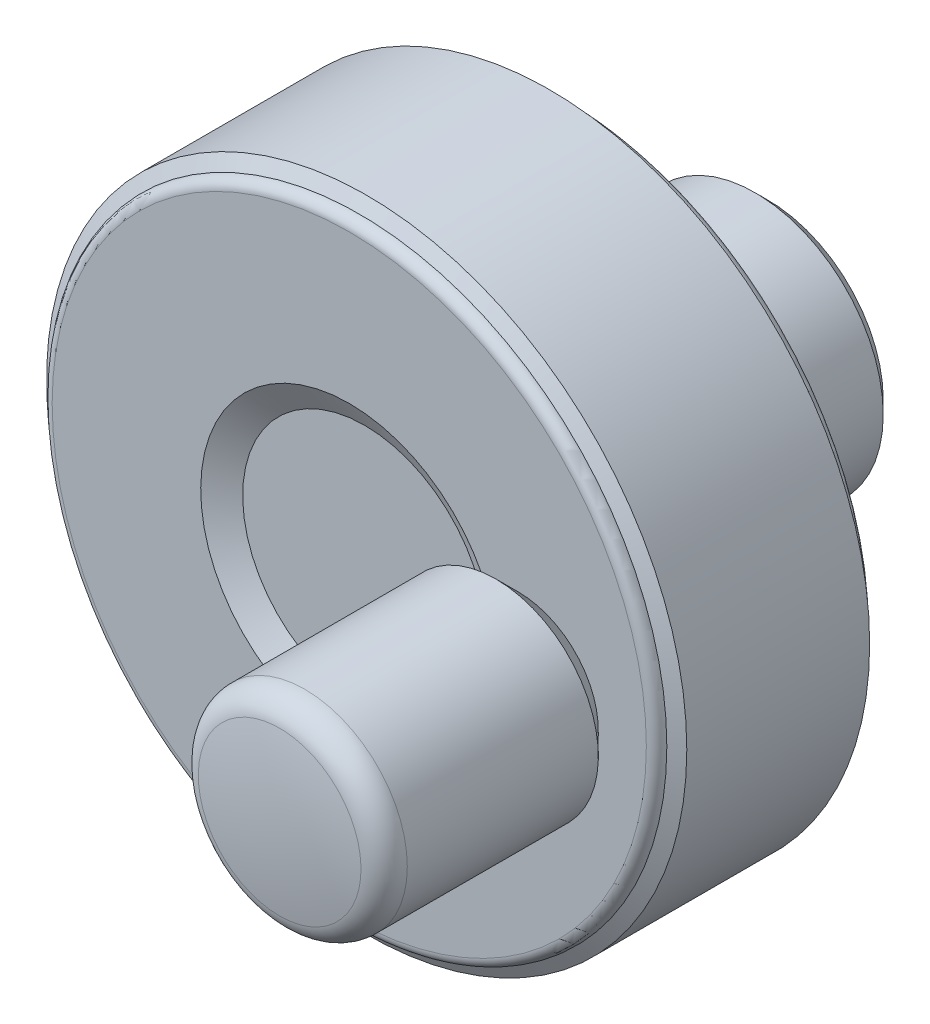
ISO-10303-21;
HEADER;
FILE_DESCRIPTION(('STEP AP214'),'2;1');
FILE_NAME('part.step','',(''),(''),'','','');
FILE_SCHEMA(('AUTOMOTIVE_DESIGN { 1 0 10303 214 1 1 1 1 }'));
ENDSEC;
DATA;
#1=APPLICATION_CONTEXT('core data for automotive mechanical design processes');
#2=APPLICATION_PROTOCOL_DEFINITION('international standard','automotive_design',2000,#1);
#3=PRODUCT_CONTEXT('',#1,'mechanical');
#4=PRODUCT('Part','Part','',(#3));
#5=PRODUCT_RELATED_PRODUCT_CATEGORY('part','',(#4));
#6=PRODUCT_DEFINITION_FORMATION('','',#4);
#7=PRODUCT_DEFINITION_CONTEXT('part definition',#1,'design');
#8=PRODUCT_DEFINITION('design','',#6,#7);
#9=PRODUCT_DEFINITION_SHAPE('','',#8);
#10=(LENGTH_UNIT() NAMED_UNIT(*) SI_UNIT(.MILLI.,.METRE.));
#11=(NAMED_UNIT(*) PLANE_ANGLE_UNIT() SI_UNIT($,.RADIAN.));
#12=(NAMED_UNIT(*) SI_UNIT($,.STERADIAN.) SOLID_ANGLE_UNIT());
#13=UNCERTAINTY_MEASURE_WITH_UNIT(LENGTH_MEASURE(1.E-05),#10,'distance_accuracy_value','');
#14=(GEOMETRIC_REPRESENTATION_CONTEXT(3) GLOBAL_UNCERTAINTY_ASSIGNED_CONTEXT((#13)) GLOBAL_UNIT_ASSIGNED_CONTEXT((#10,
#11,#12)) REPRESENTATION_CONTEXT('',''));
#15=CARTESIAN_POINT('',(0.,0.,0.));
#16=DIRECTION('',(0.,0.,1.));
#17=DIRECTION('',(1.,0.,0.));
#18=AXIS2_PLACEMENT_3D('',#15,#16,#17);
#19=CARTESIAN_POINT('',(-7.66666666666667,0.,3.55662432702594));
#20=DIRECTION('',(0.,-0.5,-0.866025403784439));
#21=DIRECTION('',(0.,-0.866025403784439,0.5));
#22=AXIS2_PLACEMENT_3D('',#19,#20,#21);
#23=PLANE('',#22);
#24=DIRECTION('',(1.,0.,0.));
#25=VECTOR('',#24,1.);
#26=CARTESIAN_POINT('',(-7.66666666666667,-1.25,4.27831216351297));
#27=LINE('',#26,#25);
#28=CARTESIAN_POINT('',(-10.,-1.25,4.27831216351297));
#29=VERTEX_POINT('',#28);
#30=CARTESIAN_POINT('',(-7.66666666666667,-1.25,4.27831216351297));
#31=VERTEX_POINT('',#30);
#32=EDGE_CURVE('E185',#29,#31,#27,.T.);
#33=ORIENTED_EDGE('',*,*,#32,.T.);
#34=DIRECTION('',(0.,-0.866025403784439,0.5));
#35=VECTOR('',#34,1.);
#36=CARTESIAN_POINT('',(-7.66666666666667,0.,3.55662432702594));
#37=LINE('',#36,#35);
#38=CARTESIAN_POINT('',(-7.66666666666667,0.,3.55662432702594));
#39=VERTEX_POINT('',#38);
#40=EDGE_CURVE('E173',#39,#31,#37,.T.);
#41=ORIENTED_EDGE('',*,*,#40,.F.);
#42=DIRECTION('',(-1.,0.,0.));
#43=VECTOR('',#42,1.);
#44=CARTESIAN_POINT('',(-7.66666666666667,0.,3.55662432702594));
#45=LINE('',#44,#43);
#46=CARTESIAN_POINT('',(-10.,0.,3.55662432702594));
#47=VERTEX_POINT('',#46);
#48=EDGE_CURVE('E199',#39,#47,#45,.T.);
#49=ORIENTED_EDGE('',*,*,#48,.T.);
#50=DIRECTION('',(0.,-0.866025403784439,0.5));
#51=VECTOR('',#50,1.);
#52=CARTESIAN_POINT('',(-10.,0.,3.55662432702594));
#53=LINE('',#52,#51);
#54=EDGE_CURVE('E177',#29,#47,#53,.F.);
#55=ORIENTED_EDGE('',*,*,#54,.F.);
#56=EDGE_LOOP('',(#33,#41,#49,#55));
#57=FACE_BOUND('',#56,.T.);
#58=ADVANCED_FACE('F14',(#57),#23,.F.);
#59=CARTESIAN_POINT('',(-7.66666666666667,-1.25,4.27831216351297));
#60=DIRECTION('',(0.,-1.,0.));
#61=DIRECTION('',(1.,0.,0.));
#62=AXIS2_PLACEMENT_3D('',#59,#60,#61);
#63=PLANE('',#62);
#64=DIRECTION('',(-1.,0.,0.));
#65=VECTOR('',#64,1.);
#66=CARTESIAN_POINT('',(-7.66666666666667,-1.25,5.72168783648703));
#67=LINE('',#66,#65);
#68=CARTESIAN_POINT('',(-10.,-1.25,5.72168783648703));
#69=VERTEX_POINT('',#68);
#70=CARTESIAN_POINT('',(-7.66666666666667,-1.25,5.72168783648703));
#71=VERTEX_POINT('',#70);
#72=EDGE_CURVE('E204',#69,#71,#67,.F.);
#73=ORIENTED_EDGE('',*,*,#72,.T.);
#74=DIRECTION('',(0.,0.,1.));
#75=VECTOR('',#74,1.);
#76=CARTESIAN_POINT('',(-7.66666666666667,-1.25,4.27831216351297));
#77=LINE('',#76,#75);
#78=EDGE_CURVE('E190',#31,#71,#77,.T.);
#79=ORIENTED_EDGE('',*,*,#78,.F.);
#80=ORIENTED_EDGE('',*,*,#32,.F.);
#81=DIRECTION('',(0.,0.,1.));
#82=VECTOR('',#81,1.);
#83=CARTESIAN_POINT('',(-10.,-1.25,4.27831216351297));
#84=LINE('',#83,#82);
#85=EDGE_CURVE('E197',#69,#29,#84,.F.);
#86=ORIENTED_EDGE('',*,*,#85,.F.);
#87=EDGE_LOOP('',(#73,#79,#80,#86));
#88=FACE_BOUND('',#87,.T.);
#89=ADVANCED_FACE('F599',(#88),#63,.F.);
#90=CARTESIAN_POINT('',(-7.66666666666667,1.25,4.27831216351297));
#91=DIRECTION('',(0.,0.5,-0.866025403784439));
#92=DIRECTION('',(0.,-0.866025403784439,-0.5));
#93=AXIS2_PLACEMENT_3D('',#90,#91,#92);
#94=PLANE('',#93);
#95=ORIENTED_EDGE('',*,*,#48,.F.);
#96=DIRECTION('',(0.,-0.866025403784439,-0.5));
#97=VECTOR('',#96,1.);
#98=CARTESIAN_POINT('',(-7.66666666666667,1.25,4.27831216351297));
#99=LINE('',#98,#97);
#100=CARTESIAN_POINT('',(-7.66666666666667,1.25,4.27831216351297));
#101=VERTEX_POINT('',#100);
#102=EDGE_CURVE('E208',#101,#39,#99,.T.);
#103=ORIENTED_EDGE('',*,*,#102,.F.);
#104=DIRECTION('',(-1.,0.,0.));
#105=VECTOR('',#104,1.);
#106=CARTESIAN_POINT('',(-7.66666666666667,1.25,4.27831216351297));
#107=LINE('',#106,#105);
#108=CARTESIAN_POINT('',(-10.,1.25,4.27831216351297));
#109=VERTEX_POINT('',#108);
#110=EDGE_CURVE('E216',#101,#109,#107,.T.);
#111=ORIENTED_EDGE('',*,*,#110,.T.);
#112=DIRECTION('',(0.,-0.866025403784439,-0.5));
#113=VECTOR('',#112,1.);
#114=CARTESIAN_POINT('',(-10.,1.25,4.27831216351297));
#115=LINE('',#114,#113);
#116=EDGE_CURVE('E202',#47,#109,#115,.F.);
#117=ORIENTED_EDGE('',*,*,#116,.F.);
#118=EDGE_LOOP('',(#95,#103,#111,#117));
#119=FACE_BOUND('',#118,.T.);
#120=ADVANCED_FACE('F591',(#119),#94,.F.);
#121=CARTESIAN_POINT('',(-7.66666666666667,-1.25,5.72168783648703));
#122=DIRECTION('',(0.,-0.5,0.866025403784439));
#123=DIRECTION('',(0.,0.866025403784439,0.5));
#124=AXIS2_PLACEMENT_3D('',#121,#122,#123);
#125=PLANE('',#124);
#126=DIRECTION('',(-1.,0.,0.));
#127=VECTOR('',#126,1.);
#128=CARTESIAN_POINT('',(-7.66666666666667,0.,6.44337567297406));
#129=LINE('',#128,#127);
#130=CARTESIAN_POINT('',(-10.,0.,6.44337567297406));
#131=VERTEX_POINT('',#130);
#132=CARTESIAN_POINT('',(-7.66666666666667,0.,6.44337567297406));
#133=VERTEX_POINT('',#132);
#134=EDGE_CURVE('E221',#131,#133,#129,.F.);
#135=ORIENTED_EDGE('',*,*,#134,.T.);
#136=DIRECTION('',(0.,0.866025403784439,0.5));
#137=VECTOR('',#136,1.);
#138=CARTESIAN_POINT('',(-7.66666666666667,-1.25,5.72168783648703));
#139=LINE('',#138,#137);
#140=EDGE_CURVE('E211',#71,#133,#139,.T.);
#141=ORIENTED_EDGE('',*,*,#140,.F.);
#142=ORIENTED_EDGE('',*,*,#72,.F.);
#143=DIRECTION('',(0.,0.866025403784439,0.5));
#144=VECTOR('',#143,1.);
#145=CARTESIAN_POINT('',(-10.,-1.25,5.72168783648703));
#146=LINE('',#145,#144);
#147=EDGE_CURVE('E34',#131,#69,#146,.F.);
#148=ORIENTED_EDGE('',*,*,#147,.F.);
#149=EDGE_LOOP('',(#135,#141,#142,#148));
#150=FACE_BOUND('',#149,.T.);
#151=ADVANCED_FACE('F582',(#150),#125,.F.);
#152=CARTESIAN_POINT('',(-7.66666666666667,0.,0.));
#153=DIRECTION('',(-1.,0.,0.));
#154=DIRECTION('',(0.,-1.,0.));
#155=AXIS2_PLACEMENT_3D('',#152,#153,#154);
#156=PLANE('',#155);
#157=ORIENTED_EDGE('',*,*,#78,.T.);
#158=ORIENTED_EDGE('',*,*,#140,.T.);
#159=DIRECTION('',(0.,0.866025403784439,-0.5));
#160=VECTOR('',#159,1.);
#161=CARTESIAN_POINT('',(-7.66666666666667,0.,6.44337567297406));
#162=LINE('',#161,#160);
#163=CARTESIAN_POINT('',(-7.66666666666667,1.25,5.72168783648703));
#164=VERTEX_POINT('',#163);
#165=EDGE_CURVE('E223',#133,#164,#162,.T.);
#166=ORIENTED_EDGE('',*,*,#165,.T.);
#167=DIRECTION('',(0.,0.,1.));
#168=VECTOR('',#167,1.);
#169=CARTESIAN_POINT('',(-7.66666666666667,1.25,5.72168783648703));
#170=LINE('',#169,#168);
#171=EDGE_CURVE('E213',#164,#101,#170,.F.);
#172=ORIENTED_EDGE('',*,*,#171,.T.);
#173=ORIENTED_EDGE('',*,*,#102,.T.);
#174=ORIENTED_EDGE('',*,*,#40,.T.);
#175=EDGE_LOOP('',(#157,#158,#166,#172,#173,#174));
#176=FACE_BOUND('',#175,.T.);
#177=ADVANCED_FACE('F573',(#176),#156,.T.);
#178=CARTESIAN_POINT('',(-7.66666666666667,1.25,5.72168783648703));
#179=DIRECTION('',(0.,1.,0.));
#180=DIRECTION('',(-1.,0.,0.));
#181=AXIS2_PLACEMENT_3D('',#178,#179,#180);
#182=PLANE('',#181);
#183=ORIENTED_EDGE('',*,*,#110,.F.);
#184=ORIENTED_EDGE('',*,*,#171,.F.);
#185=DIRECTION('',(-1.,0.,0.));
#186=VECTOR('',#185,1.);
#187=CARTESIAN_POINT('',(-7.66666666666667,1.25,5.72168783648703));
#188=LINE('',#187,#186);
#189=CARTESIAN_POINT('',(-10.,1.25,5.72168783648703));
#190=VERTEX_POINT('',#189);
#191=EDGE_CURVE('E226',#164,#190,#188,.T.);
#192=ORIENTED_EDGE('',*,*,#191,.T.);
#193=DIRECTION('',(0.,0.,1.));
#194=VECTOR('',#193,1.);
#195=CARTESIAN_POINT('',(-10.,1.25,5.72168783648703));
#196=LINE('',#195,#194);
#197=EDGE_CURVE('E219',#109,#190,#196,.T.);
#198=ORIENTED_EDGE('',*,*,#197,.F.);
#199=EDGE_LOOP('',(#183,#184,#192,#198));
#200=FACE_BOUND('',#199,.T.);
#201=ADVANCED_FACE('F564',(#200),#182,.F.);
#202=CARTESIAN_POINT('',(-7.66666666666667,0.,6.44337567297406));
#203=DIRECTION('',(0.,0.5,0.866025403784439));
#204=DIRECTION('',(0.,0.866025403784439,-0.5));
#205=AXIS2_PLACEMENT_3D('',#202,#203,#204);
#206=PLANE('',#205);
#207=ORIENTED_EDGE('',*,*,#191,.F.);
#208=ORIENTED_EDGE('',*,*,#165,.F.);
#209=ORIENTED_EDGE('',*,*,#134,.F.);
#210=DIRECTION('',(0.,0.866025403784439,-0.5));
#211=VECTOR('',#210,1.);
#212=CARTESIAN_POINT('',(-10.,0.,6.44337567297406));
#213=LINE('',#212,#211);
#214=EDGE_CURVE('E229',#131,#190,#213,.T.);
#215=ORIENTED_EDGE('',*,*,#214,.T.);
#216=EDGE_LOOP('',(#207,#208,#209,#215));
#217=FACE_BOUND('',#216,.T.);
#218=ADVANCED_FACE('F559',(#217),#206,.F.);
#219=CARTESIAN_POINT('',(0.,0.,20.));
#220=DIRECTION('',(0.,0.,1.));
#221=DIRECTION('',(1.,0.,0.));
#222=AXIS2_PLACEMENT_3D('',#219,#220,#221);
#223=CYLINDRICAL_SURFACE('',#222,3.);
#224=CARTESIAN_POINT('',(0.,0.,0.));
#225=DIRECTION('',(0.,0.,1.));
#226=DIRECTION('',(1.,0.,0.));
#227=AXIS2_PLACEMENT_3D('',#224,#225,#226);
#228=CIRCLE('',#227,3.);
#229=CARTESIAN_POINT('',(3.,0.,0.));
#230=VERTEX_POINT('',#229);
#231=EDGE_CURVE('E232',#230,#230,#228,.F.);
#232=ORIENTED_EDGE('',*,*,#231,.T.);
#233=EDGE_LOOP('',(#232));
#234=FACE_BOUND('',#233,.T.);
#235=CARTESIAN_POINT('',(0.,0.,18.));
#236=DIRECTION('',(0.,0.,-1.));
#237=DIRECTION('',(0.,1.,0.));
#238=AXIS2_PLACEMENT_3D('',#235,#236,#237);
#239=CIRCLE('',#238,3.);
#240=CARTESIAN_POINT('',(0.,3.,18.));
#241=VERTEX_POINT('',#240);
#242=EDGE_CURVE('E363',#241,#241,#239,.T.);
#243=ORIENTED_EDGE('',*,*,#242,.F.);
#244=EDGE_LOOP('',(#243));
#245=FACE_BOUND('',#244,.T.);
#246=ADVANCED_FACE('F553',(#234,#245),#223,.F.);
#247=CARTESIAN_POINT('',(-10.,0.,7.0095));
#248=DIRECTION('',(1.,0.,0.));
#249=DIRECTION('',(0.,1.,0.));
#250=AXIS2_PLACEMENT_3D('',#247,#248,#249);
#251=PLANE('',#250);
#252=CARTESIAN_POINT('',(-9.99999999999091,0.,5.));
#253=DIRECTION('',(1.,0.,0.));
#254=DIRECTION('',(0.,1.,0.));
#255=AXIS2_PLACEMENT_3D('',#252,#253,#254);
#256=CIRCLE('',#255,2.00949999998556);
#257=CARTESIAN_POINT('',(-9.99999999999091,2.00949999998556,5.));
#258=VERTEX_POINT('',#257);
#259=EDGE_CURVE('E684',#258,#258,#256,.T.);
#260=ORIENTED_EDGE('',*,*,#259,.F.);
#261=EDGE_LOOP('',(#260));
#262=FACE_BOUND('',#261,.T.);
#263=ORIENTED_EDGE('',*,*,#147,.T.);
#264=ORIENTED_EDGE('',*,*,#85,.T.);
#265=ORIENTED_EDGE('',*,*,#54,.T.);
#266=ORIENTED_EDGE('',*,*,#116,.T.);
#267=ORIENTED_EDGE('',*,*,#197,.T.);
#268=ORIENTED_EDGE('',*,*,#214,.F.);
#269=EDGE_LOOP('',(#263,#264,#265,#266,#267,#268));
#270=FACE_BOUND('',#269,.T.);
#271=ADVANCED_FACE('F548',(#262,#270),#251,.F.);
#272=CARTESIAN_POINT('',(-7.5,0.,0.));
#273=DIRECTION('',(0.,0.,1.));
#274=DIRECTION('',(1.,0.,0.));
#275=AXIS2_PLACEMENT_3D('',#272,#273,#274);
#276=PLANE('',#275);
#277=CARTESIAN_POINT('',(0.,0.,0.));
#278=DIRECTION('',(0.,0.,1.));
#279=DIRECTION('',(1.,0.,0.));
#280=AXIS2_PLACEMENT_3D('',#277,#278,#279);
#281=CIRCLE('',#280,7.5);
#282=CARTESIAN_POINT('',(7.5,0.,0.));
#283=VERTEX_POINT('',#282);
#284=EDGE_CURVE('E239',#283,#283,#281,.T.);
#285=ORIENTED_EDGE('',*,*,#284,.F.);
#286=EDGE_LOOP('',(#285));
#287=FACE_BOUND('',#286,.T.);
#288=ORIENTED_EDGE('',*,*,#231,.F.);
#289=EDGE_LOOP('',(#288));
#290=FACE_BOUND('',#289,.T.);
#291=ADVANCED_FACE('F542',(#287,#290),#276,.F.);
#292=CARTESIAN_POINT('',(-9.50949999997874,0.,5.));
#293=DIRECTION('',(1.,0.,0.));
#294=DIRECTION('',(0.,1.,0.));
#295=AXIS2_PLACEMENT_3D('',#292,#293,#294);
#296=CONICAL_SURFACE('',#295,2.50000000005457,0.785398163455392);
#297=CARTESIAN_POINT('',(-9.5095,0.,5.));
#298=DIRECTION('',(1.,0.,0.));
#299=DIRECTION('',(0.,1.,0.));
#300=AXIS2_PLACEMENT_3D('',#297,#298,#299);
#301=CIRCLE('',#300,2.5);
#302=CARTESIAN_POINT('',(-9.5095,2.5,5.));
#303=VERTEX_POINT('',#302);
#304=EDGE_CURVE('E235',#303,#303,#301,.T.);
#305=ORIENTED_EDGE('',*,*,#304,.F.);
#306=EDGE_LOOP('',(#305));
#307=FACE_BOUND('',#306,.T.);
#308=ORIENTED_EDGE('',*,*,#259,.T.);
#309=EDGE_LOOP('',(#308));
#310=FACE_BOUND('',#309,.T.);
#311=ADVANCED_FACE('F533',(#307,#310),#296,.T.);
#312=CARTESIAN_POINT('',(0.,0.,20.));
#313=DIRECTION('',(0.,0.,1.));
#314=DIRECTION('',(1.,0.,0.));
#315=AXIS2_PLACEMENT_3D('',#312,#313,#314);
#316=CYLINDRICAL_SURFACE('',#315,7.5);
#317=CARTESIAN_POINT('',(0.,0.,0.3));
#318=DIRECTION('',(0.,0.,1.));
#319=DIRECTION('',(1.,0.,0.));
#320=AXIS2_PLACEMENT_3D('',#317,#318,#319);
#321=CIRCLE('',#320,7.5);
#322=CARTESIAN_POINT('',(7.5,0.,0.3));
#323=VERTEX_POINT('',#322);
#324=EDGE_CURVE('E238',#323,#323,#321,.F.);
#325=ORIENTED_EDGE('',*,*,#324,.T.);
#326=EDGE_LOOP('',(#325));
#327=FACE_BOUND('',#326,.T.);
#328=ORIENTED_EDGE('',*,*,#284,.T.);
#329=EDGE_LOOP('',(#328));
#330=FACE_BOUND('',#329,.T.);
#331=ADVANCED_FACE('F524',(#327,#330),#316,.T.);
#332=CARTESIAN_POINT('',(-10.,0.,5.));
#333=DIRECTION('',(1.,0.,0.));
#334=DIRECTION('',(0.,1.,0.));
#335=AXIS2_PLACEMENT_3D('',#332,#333,#334);
#336=CYLINDRICAL_SURFACE('',#335,2.5);
#337=CARTESIAN_POINT('',(-7.49999999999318,0.,5.));
#338=DIRECTION('',(-1.,0.,0.));
#339=DIRECTION('',(0.,-1.,0.));
#340=AXIS2_PLACEMENT_3D('',#337,#338,#339);
#341=CIRCLE('',#340,2.49999999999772);
#342=CARTESIAN_POINT('',(-7.49999999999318,-2.49999999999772,5.));
#343=VERTEX_POINT('',#342);
#344=EDGE_CURVE('E242',#343,#343,#341,.T.);
#345=ORIENTED_EDGE('',*,*,#344,.T.);
#346=EDGE_LOOP('',(#345));
#347=FACE_BOUND('',#346,.T.);
#348=ORIENTED_EDGE('',*,*,#304,.T.);
#349=EDGE_LOOP('',(#348));
#350=FACE_BOUND('',#349,.T.);
#351=ADVANCED_FACE('F515',(#347,#350),#336,.T.);
#352=CARTESIAN_POINT('',(-9.,0.,0.3));
#353=DIRECTION('',(0.,0.,1.));
#354=DIRECTION('',(1.,0.,0.));
#355=AXIS2_PLACEMENT_3D('',#352,#353,#354);
#356=PLANE('',#355);
#357=CARTESIAN_POINT('',(0.,0.,0.3));
#358=DIRECTION('',(0.,0.,1.));
#359=DIRECTION('',(1.,0.,0.));
#360=AXIS2_PLACEMENT_3D('',#357,#358,#359);
#361=CIRCLE('',#360,9.);
#362=CARTESIAN_POINT('',(9.,0.,0.3));
#363=VERTEX_POINT('',#362);
#364=EDGE_CURVE('E245',#363,#363,#361,.T.);
#365=ORIENTED_EDGE('',*,*,#364,.F.);
#366=EDGE_LOOP('',(#365));
#367=FACE_BOUND('',#366,.T.);
#368=ORIENTED_EDGE('',*,*,#324,.F.);
#369=EDGE_LOOP('',(#368));
#370=FACE_BOUND('',#369,.T.);
#371=ADVANCED_FACE('F506',(#367,#370),#356,.F.);
#372=CARTESIAN_POINT('',(-7.77777777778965,0.,5.));
#373=DIRECTION('',(-1.,0.,0.));
#374=DIRECTION('',(0.,0.,1.));
#375=AXIS2_PLACEMENT_3D('',#372,#373,#374);
#376=CONICAL_SURFACE('',#375,2.7777777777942,0.785398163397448);
#377=ORIENTED_EDGE('',*,*,#344,.F.);
#378=EDGE_LOOP('',(#377));
#379=FACE_BOUND('',#378,.T.);
#380=CARTESIAN_POINT('',(-7.77777777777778,0.,5.));
#381=DIRECTION('',(1.,0.,0.));
#382=DIRECTION('',(0.,1.,0.));
#383=AXIS2_PLACEMENT_3D('',#380,#381,#382);
#384=CIRCLE('',#383,2.77777777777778);
#385=CARTESIAN_POINT('',(-7.77777777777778,2.77777777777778,5.));
#386=VERTEX_POINT('',#385);
#387=EDGE_CURVE('E253',#386,#386,#384,.F.);
#388=ORIENTED_EDGE('',*,*,#387,.T.);
#389=EDGE_LOOP('',(#388));
#390=FACE_BOUND('',#389,.T.);
#391=ADVANCED_FACE('F498',(#379,#390),#376,.F.);
#392=CARTESIAN_POINT('',(0.,0.,1.3));
#393=DIRECTION('',(0.,0.,1.));
#394=DIRECTION('',(1.,0.,0.));
#395=AXIS2_PLACEMENT_3D('',#392,#393,#394);
#396=CONICAL_SURFACE('',#395,10.,0.785398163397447);
#397=CARTESIAN_POINT('',(0.,0.,1.3));
#398=DIRECTION('',(0.,0.,1.));
#399=DIRECTION('',(1.,0.,0.));
#400=AXIS2_PLACEMENT_3D('',#397,#398,#399);
#401=CIRCLE('',#400,10.);
#402=CARTESIAN_POINT('',(10.,0.,1.3));
#403=VERTEX_POINT('',#402);
#404=EDGE_CURVE('E256',#403,#403,#401,.T.);
#405=ORIENTED_EDGE('',*,*,#404,.F.);
#406=EDGE_LOOP('',(#405));
#407=FACE_BOUND('',#406,.T.);
#408=ORIENTED_EDGE('',*,*,#364,.T.);
#409=EDGE_LOOP('',(#408));
#410=FACE_BOUND('',#409,.T.);
#411=ADVANCED_FACE('F489',(#407,#410),#396,.T.);
#412=CARTESIAN_POINT('',(-10.,0.,5.));
#413=DIRECTION('',(1.,0.,0.));
#414=DIRECTION('',(0.,1.,0.));
#415=AXIS2_PLACEMENT_3D('',#412,#413,#414);
#416=CYLINDRICAL_SURFACE('',#415,2.77777777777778);
#417=ORIENTED_EDGE('',*,*,#387,.F.);
#418=EDGE_LOOP('',(#417));
#419=FACE_BOUND('',#418,.T.);
#420=CARTESIAN_POINT('',(-9.99905170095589,-0.137715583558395,7.77436189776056));
#421=CARTESIAN_POINT('',(-9.99693778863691,-0.29104213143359,7.76674758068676));
#422=CARTESIAN_POINT('',(-9.99127533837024,-0.443722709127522,7.74638734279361));
#423=CARTESIAN_POINT('',(-9.97346727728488,-0.743312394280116,7.68087211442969));
#424=CARTESIAN_POINT('',(-9.96131845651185,-0.890218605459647,7.63570484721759));
#425=CARTESIAN_POINT('',(-9.93187811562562,-1.17393500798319,7.52215007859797));
#426=CARTESIAN_POINT('',(-9.91459417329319,-1.31075970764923,7.45379677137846));
#427=CARTESIAN_POINT('',(-9.87669787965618,-1.5710381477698,7.29588097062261));
#428=CARTESIAN_POINT('',(-9.85608527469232,-1.69449086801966,7.20631686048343));
#429=CARTESIAN_POINT('',(-9.81317114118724,-1.92771294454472,7.00602805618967));
#430=CARTESIAN_POINT('',(-9.79084132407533,-2.03709304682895,6.89485596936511));
#431=CARTESIAN_POINT('',(-9.74737534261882,-2.23585552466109,6.65565216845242));
#432=CARTESIAN_POINT('',(-9.72623929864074,-2.32523588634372,6.52761875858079));
#433=CARTESIAN_POINT('',(-9.68730754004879,-2.48248715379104,6.2562634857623));
#434=CARTESIAN_POINT('',(-9.66955726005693,-2.55007290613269,6.11276934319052));
#435=CARTESIAN_POINT('',(-9.63990567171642,-2.6599790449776,5.8158457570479));
#436=CARTESIAN_POINT('',(-9.6280029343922,-2.70230560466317,5.66241875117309));
#437=CARTESIAN_POINT('',(-9.61181240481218,-2.75933389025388,5.3547897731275));
#438=CARTESIAN_POINT('',(-9.60731145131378,-2.77480963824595,5.20074259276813));
#439=CARTESIAN_POINT('',(-9.60582050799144,-2.77996851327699,4.89219405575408));
#440=CARTESIAN_POINT('',(-9.60882933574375,-2.76965570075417,4.73769277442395));
#441=CARTESIAN_POINT('',(-9.62180409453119,-2.72422629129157,4.43679320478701));
#442=CARTESIAN_POINT('',(-9.63158885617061,-2.68975533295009,4.29028870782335));
#443=CARTESIAN_POINT('',(-9.65678089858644,-2.59785208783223,4.005186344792));
#444=CARTESIAN_POINT('',(-9.67218884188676,-2.54041709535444,3.86658941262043));
#445=CARTESIAN_POINT('',(-9.70724856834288,-2.40300344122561,3.59829737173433));
#446=CARTESIAN_POINT('',(-9.72697510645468,-2.32261894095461,3.4688202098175));
#447=CARTESIAN_POINT('',(-9.76834090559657,-2.14198110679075,3.22489124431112));
#448=CARTESIAN_POINT('',(-9.78998056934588,-2.04172358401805,3.11044261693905));
#449=CARTESIAN_POINT('',(-9.83362737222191,-1.82014432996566,2.89578726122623));
#450=CARTESIAN_POINT('',(-9.85562207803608,-1.69822345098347,2.79619530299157));
#451=CARTESIAN_POINT('',(-9.89679236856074,-1.43899243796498,2.61882116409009));
#452=CARTESIAN_POINT('',(-9.91596797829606,-1.30168244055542,2.5410387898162));
#453=CARTESIAN_POINT('',(-9.94932452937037,-1.01567678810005,2.40979851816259));
#454=CARTESIAN_POINT('',(-9.96351652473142,-0.867007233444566,2.35628670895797));
#455=CARTESIAN_POINT('',(-9.98534457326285,-0.562307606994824,2.27517004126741));
#456=CARTESIAN_POINT('',(-9.9929822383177,-0.406279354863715,2.24755881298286));
#457=CARTESIAN_POINT('',(-10.0006901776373,-0.0968006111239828,2.21970816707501));
#458=CARTESIAN_POINT('',(-10.0010009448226,0.056566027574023,2.21859885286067));
#459=CARTESIAN_POINT('',(-9.99463452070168,0.361240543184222,2.24157847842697));
#460=CARTESIAN_POINT('',(-9.98795783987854,0.512548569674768,2.26566557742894));
#461=CARTESIAN_POINT('',(-9.96847527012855,0.806837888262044,2.33772246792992));
#462=CARTESIAN_POINT('',(-9.95574988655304,0.949901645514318,2.38537889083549));
#463=CARTESIAN_POINT('',(-9.92552984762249,1.22603864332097,2.50292066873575));
#464=CARTESIAN_POINT('',(-9.90803452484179,1.3591104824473,2.57280913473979));
#465=CARTESIAN_POINT('',(-9.8695657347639,1.61520279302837,2.73489156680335));
#466=CARTESIAN_POINT('',(-9.8485148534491,1.73787978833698,2.82760958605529));
#467=CARTESIAN_POINT('',(-9.80548195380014,1.96622732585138,3.03188464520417));
#468=CARTESIAN_POINT('',(-9.78349974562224,2.0718943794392,3.14344554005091));
#469=CARTESIAN_POINT('',(-9.74035937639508,2.2661850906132,3.38592317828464));
#470=CARTESIAN_POINT('',(-9.71924061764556,2.35425882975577,3.51728859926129));
#471=CARTESIAN_POINT('',(-9.68095689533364,2.50705132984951,3.7934994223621));
#472=CARTESIAN_POINT('',(-9.66379152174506,2.57177251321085,3.93834342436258));
#473=CARTESIAN_POINT('',(-9.63570111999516,2.6750916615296,4.23556289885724));
#474=CARTESIAN_POINT('',(-9.62469893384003,2.71401379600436,4.3878180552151));
#475=CARTESIAN_POINT('',(-9.60999075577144,2.76564974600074,4.69703987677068));
#476=CARTESIAN_POINT('',(-9.60628282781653,2.77837051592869,4.85400528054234));
#477=CARTESIAN_POINT('',(-9.6066304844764,2.7771639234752,5.16226219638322));
#478=CARTESIAN_POINT('',(-9.61041679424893,2.76416085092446,5.31355851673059));
#479=CARTESIAN_POINT('',(-9.62475693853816,2.71380332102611,5.61170148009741));
#480=CARTESIAN_POINT('',(-9.63531087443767,2.67644849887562,5.75854805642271));
#481=CARTESIAN_POINT('',(-9.66192630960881,2.57870488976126,6.04355083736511));
#482=CARTESIAN_POINT('',(-9.67797937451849,2.51835136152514,6.18171996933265));
#483=CARTESIAN_POINT('',(-9.71380937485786,2.37639368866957,6.44614388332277));
#484=CARTESIAN_POINT('',(-9.73358700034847,2.29478560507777,6.57239645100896));
#485=CARTESIAN_POINT('',(-9.77548378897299,2.10932222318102,6.81405570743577));
#486=CARTESIAN_POINT('',(-9.7976601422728,2.00479742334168,6.92893899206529));
#487=CARTESIAN_POINT('',(-9.84134323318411,1.77799868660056,7.13980173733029));
#488=CARTESIAN_POINT('',(-9.86284982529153,1.65572092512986,7.23577711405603));
#489=CARTESIAN_POINT('',(-9.90322981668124,1.39421354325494,7.40772423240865));
#490=CARTESIAN_POINT('',(-9.92204954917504,1.25472098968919,7.48330962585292));
#491=CARTESIAN_POINT('',(-9.9544522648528,0.964440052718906,7.60977606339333));
#492=CARTESIAN_POINT('',(-9.96803865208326,0.813659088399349,7.66067317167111));
#493=CARTESIAN_POINT('',(-9.98682090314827,0.529530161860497,7.73012052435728));
#494=CARTESIAN_POINT('',(-9.99300040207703,0.397170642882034,7.75249947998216));
#495=CARTESIAN_POINT('',(-10.000038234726,0.130471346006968,7.77794276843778));
#496=CARTESIAN_POINT('',(-10.0008970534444,-0.0038682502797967,7.78100886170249));
#497=CARTESIAN_POINT('',(-9.99905170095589,-0.137715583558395,7.77436189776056));
#498=B_SPLINE_CURVE_WITH_KNOTS('',3,(#420,#421,#422,#423,#424,#425,#426,#427,#428,#429,#430,
#431,#432,#433,#434,#435,#436,#437,#438,#439,#440,#441,#442,#443,#444,#445,#446,#447,#448,#449,
#450,#451,#452,#453,#454,#455,#456,#457,#458,#459,#460,#461,#462,#463,#464,#465,#466,#467,#468,
#469,#470,#471,#472,#473,#474,#475,#476,#477,#478,#479,#480,#481,#482,#483,#484,#485,#486,#487,
#488,#489,#490,#491,#492,#493,#494,#495,#496,#497),.UNSPECIFIED.,.T.,.F.,(4,2,2,2,2,2,2,2,2,2,2,
2,2,2,2,2,2,2,2,2,2,2,2,2,2,2,2,2,2,2,2,2,2,2,2,2,2,2,4),(0.,0.460094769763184,
0.920417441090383,1.38006417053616,1.83974594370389,2.3102188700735,2.78073914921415,
3.25718687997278,3.73351812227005,4.1958748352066,4.65815875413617,5.10853698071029,
5.55896828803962,6.01791892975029,6.47696641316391,6.95158487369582,7.42619912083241,
7.89975388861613,8.37319216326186,8.83106820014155,9.28891078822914,9.74082341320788,
10.192799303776,10.6563176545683,11.1199309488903,11.5963202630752,12.0726601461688,
12.5428951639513,13.013005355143,13.4665304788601,13.9200623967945,14.3729017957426,
14.8258251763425,15.2943500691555,15.7629760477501,16.2399410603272,16.7165953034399,
17.1182744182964,17.5199169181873),.UNSPECIFIED.);
#499=CARTESIAN_POINT('',(-9.99905170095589,-0.137715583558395,7.77436189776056));
#500=VERTEX_POINT('',#499);
#501=EDGE_CURVE('E261',#500,#500,#498,.T.);
#502=ORIENTED_EDGE('',*,*,#501,.F.);
#503=EDGE_LOOP('',(#502));
#504=FACE_BOUND('',#503,.T.);
#505=ADVANCED_FACE('F316',(#419,#504),#416,.F.);
#506=CARTESIAN_POINT('',(0.,0.,20.));
#507=DIRECTION('',(0.,0.,1.));
#508=DIRECTION('',(1.,0.,0.));
#509=AXIS2_PLACEMENT_3D('',#506,#507,#508);
#510=CYLINDRICAL_SURFACE('',#509,10.);
#511=CARTESIAN_POINT('',(0.,0.,30.8));
#512=DIRECTION('',(0.,0.,1.));
#513=DIRECTION('',(1.,0.,0.));
#514=AXIS2_PLACEMENT_3D('',#511,#512,#513);
#515=CIRCLE('',#514,10.);
#516=CARTESIAN_POINT('',(10.,0.,30.8));
#517=VERTEX_POINT('',#516);
#518=EDGE_CURVE('E250',#517,#517,#515,.T.);
#519=ORIENTED_EDGE('',*,*,#518,.F.);
#520=EDGE_LOOP('',(#519));
#521=FACE_BOUND('',#520,.T.);
#522=ORIENTED_EDGE('',*,*,#501,.T.);
#523=EDGE_LOOP('',(#522));
#524=FACE_BOUND('',#523,.T.);
#525=ORIENTED_EDGE('',*,*,#404,.T.);
#526=EDGE_LOOP('',(#525));
#527=FACE_BOUND('',#526,.T.);
#528=ADVANCED_FACE('F319',(#521,#524,#527),#510,.T.);
#529=CARTESIAN_POINT('',(0.,0.,20.));
#530=DIRECTION('',(0.,0.,1.));
#531=DIRECTION('',(1.,0.,0.));
#532=AXIS2_PLACEMENT_3D('',#529,#530,#531);
#533=CYLINDRICAL_SURFACE('',#532,25.);
#534=CARTESIAN_POINT('',(0.,0.,31.64));
#535=DIRECTION('',(0.,0.,1.));
#536=DIRECTION('',(1.,0.,0.));
#537=AXIS2_PLACEMENT_3D('',#534,#535,#536);
#538=CIRCLE('',#537,25.);
#539=CARTESIAN_POINT('',(25.,0.,31.64));
#540=VERTEX_POINT('',#539);
#541=EDGE_CURVE('E183',#540,#540,#538,.F.);
#542=ORIENTED_EDGE('',*,*,#541,.T.);
#543=EDGE_LOOP('',(#542));
#544=FACE_BOUND('',#543,.T.);
#545=CARTESIAN_POINT('',(0.,0.,17.36));
#546=DIRECTION('',(0.,0.,1.));
#547=DIRECTION('',(1.,0.,0.));
#548=AXIS2_PLACEMENT_3D('',#545,#546,#547);
#549=CIRCLE('',#548,25.);
#550=CARTESIAN_POINT('',(25.,0.,17.36));
#551=VERTEX_POINT('',#550);
#552=EDGE_CURVE('E246',#551,#551,#549,.F.);
#553=ORIENTED_EDGE('',*,*,#552,.F.);
#554=EDGE_LOOP('',(#553));
#555=FACE_BOUND('',#554,.T.);
#556=ADVANCED_FACE('F323',(#544,#555),#533,.T.);
#557=CARTESIAN_POINT('',(0.,0.,31.8));
#558=DIRECTION('',(0.,0.,1.));
#559=DIRECTION('',(0.,1.,0.));
#560=AXIS2_PLACEMENT_3D('',#557,#558,#559);
#561=CONICAL_SURFACE('',#560,11.,0.78539816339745);
#562=CARTESIAN_POINT('',(0.,0.,31.8));
#563=DIRECTION('',(0.,0.,1.));
#564=DIRECTION('',(0.,1.,0.));
#565=AXIS2_PLACEMENT_3D('',#562,#563,#564);
#566=CIRCLE('',#565,11.);
#567=CARTESIAN_POINT('',(0.,11.,31.8));
#568=VERTEX_POINT('',#567);
#569=EDGE_CURVE('E249',#568,#568,#566,.F.);
#570=ORIENTED_EDGE('',*,*,#569,.T.);
#571=EDGE_LOOP('',(#570));
#572=FACE_BOUND('',#571,.T.);
#573=ORIENTED_EDGE('',*,*,#518,.T.);
#574=EDGE_LOOP('',(#573));
#575=FACE_BOUND('',#574,.T.);
#576=ADVANCED_FACE('F327',(#572,#575),#561,.T.);
#577=CARTESIAN_POINT('',(0.,0.,17.36));
#578=DIRECTION('',(0.,0.,1.));
#579=DIRECTION('',(1.,0.,0.));
#580=AXIS2_PLACEMENT_3D('',#577,#578,#579);
#581=CONICAL_SURFACE('',#580,25.,1.06030800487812);
#582=ORIENTED_EDGE('',*,*,#552,.T.);
#583=EDGE_LOOP('',(#582));
#584=FACE_BOUND('',#583,.T.);
#585=CARTESIAN_POINT('',(0.,0.,16.8));
#586=DIRECTION('',(0.,0.,-1.));
#587=DIRECTION('',(-1.,0.,0.));
#588=AXIS2_PLACEMENT_3D('',#585,#586,#587);
#589=CIRCLE('',#588,24.);
#590=CARTESIAN_POINT('',(-24.,0.,16.8));
#591=VERTEX_POINT('',#590);
#592=EDGE_CURVE('E294',#591,#591,#589,.T.);
#593=ORIENTED_EDGE('',*,*,#592,.F.);
#594=EDGE_LOOP('',(#593));
#595=FACE_BOUND('',#594,.T.);
#596=ADVANCED_FACE('F329',(#584,#595),#581,.T.);
#597=CARTESIAN_POINT('',(-20.,0.,31.8));
#598=DIRECTION('',(0.,0.,1.));
#599=DIRECTION('',(1.,0.,0.));
#600=AXIS2_PLACEMENT_3D('',#597,#598,#599);
#601=PLANE('',#600);
#602=CARTESIAN_POINT('',(0.,0.,31.8));
#603=DIRECTION('',(0.,0.,-1.));
#604=DIRECTION('',(0.,-1.,0.));
#605=AXIS2_PLACEMENT_3D('',#602,#603,#604);
#606=CIRCLE('',#605,20.);
#607=CARTESIAN_POINT('',(0.,-20.,31.8));
#608=VERTEX_POINT('',#607);
#609=EDGE_CURVE('E296',#608,#608,#606,.T.);
#610=ORIENTED_EDGE('',*,*,#609,.T.);
#611=EDGE_LOOP('',(#610));
#612=FACE_BOUND('',#611,.T.);
#613=ORIENTED_EDGE('',*,*,#569,.F.);
#614=EDGE_LOOP('',(#613));
#615=FACE_BOUND('',#614,.T.);
#616=ADVANCED_FACE('F284',(#612,#615),#601,.F.);
#617=CARTESIAN_POINT('',(0.,0.,16.8));
#618=DIRECTION('',(0.,0.,-1.));
#619=DIRECTION('',(-1.,0.,0.));
#620=AXIS2_PLACEMENT_3D('',#617,#618,#619);
#621=TOROIDAL_SURFACE('',#620,23.2,0.800000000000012);
#622=CARTESIAN_POINT('',(0.,0.,16.));
#623=DIRECTION('',(0.,0.,1.));
#624=DIRECTION('',(-1.,0.,0.));
#625=AXIS2_PLACEMENT_3D('',#622,#623,#624);
#626=CIRCLE('',#625,23.2);
#627=CARTESIAN_POINT('',(-23.2,0.,16.));
#628=VERTEX_POINT('',#627);
#629=EDGE_CURVE('E301',#628,#628,#626,.T.);
#630=ORIENTED_EDGE('',*,*,#629,.T.);
#631=EDGE_LOOP('',(#630));
#632=FACE_BOUND('',#631,.T.);
#633=ORIENTED_EDGE('',*,*,#592,.T.);
#634=EDGE_LOOP('',(#633));
#635=FACE_BOUND('',#634,.T.);
#636=ADVANCED_FACE('F272',(#632,#635),#621,.T.);
#637=CARTESIAN_POINT('',(0.,0.,30.8));
#638=DIRECTION('',(0.,0.,-1.));
#639=DIRECTION('',(0.,-1.,0.));
#640=AXIS2_PLACEMENT_3D('',#637,#638,#639);
#641=CONICAL_SURFACE('',#640,21.,0.785398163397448);
#642=CARTESIAN_POINT('',(0.,0.,30.8));
#643=DIRECTION('',(0.,0.,1.));
#644=DIRECTION('',(1.,0.,0.));
#645=AXIS2_PLACEMENT_3D('',#642,#643,#644);
#646=CIRCLE('',#645,21.);
#647=CARTESIAN_POINT('',(21.,0.,30.8));
#648=VERTEX_POINT('',#647);
#649=EDGE_CURVE('E25',#648,#648,#646,.F.);
#650=ORIENTED_EDGE('',*,*,#649,.T.);
#651=EDGE_LOOP('',(#650));
#652=FACE_BOUND('',#651,.T.);
#653=ORIENTED_EDGE('',*,*,#609,.F.);
#654=EDGE_LOOP('',(#653));
#655=FACE_BOUND('',#654,.T.);
#656=ADVANCED_FACE('F283',(#652,#655),#641,.F.);
#657=CARTESIAN_POINT('',(-23.2,0.,16.));
#658=DIRECTION('',(0.,0.,1.));
#659=DIRECTION('',(1.,0.,0.));
#660=AXIS2_PLACEMENT_3D('',#657,#658,#659);
#661=PLANE('',#660);
#662=ORIENTED_EDGE('',*,*,#629,.F.);
#663=EDGE_LOOP('',(#662));
#664=FACE_BOUND('',#663,.T.);
#665=CARTESIAN_POINT('',(0.,0.,16.));
#666=DIRECTION('',(0.,0.,1.));
#667=DIRECTION('',(1.,0.,0.));
#668=AXIS2_PLACEMENT_3D('',#665,#666,#667);
#669=CIRCLE('',#668,21.);
#670=CARTESIAN_POINT('',(21.,0.,16.));
#671=VERTEX_POINT('',#670);
#672=EDGE_CURVE('E9',#671,#671,#669,.T.);
#673=ORIENTED_EDGE('',*,*,#672,.T.);
#674=EDGE_LOOP('',(#673));
#675=FACE_BOUND('',#674,.T.);
#676=ADVANCED_FACE('F340',(#664,#675),#661,.F.);
#677=CARTESIAN_POINT('',(0.,0.,20.));
#678=DIRECTION('',(0.,0.,1.));
#679=DIRECTION('',(1.,0.,0.));
#680=AXIS2_PLACEMENT_3D('',#677,#678,#679);
#681=CYLINDRICAL_SURFACE('',#680,21.);
#682=ORIENTED_EDGE('',*,*,#672,.F.);
#683=EDGE_LOOP('',(#682));
#684=FACE_BOUND('',#683,.T.);
#685=ORIENTED_EDGE('',*,*,#649,.F.);
#686=EDGE_LOOP('',(#685));
#687=FACE_BOUND('',#686,.T.);
#688=ADVANCED_FACE('F338',(#684,#687),#681,.F.);
#689=CARTESIAN_POINT('',(14.,0.,16.994444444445));
#690=DIRECTION('',(0.,-1.,0.));
#691=DIRECTION('',(-1.,0.,0.));
#692=AXIS2_PLACEMENT_3D('',#689,#690,#691);
#693=SPHERICAL_SURFACE('',#692,36.005555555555);
#694=CARTESIAN_POINT('',(14.,0.,52.435111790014));
#695=DIRECTION('',(0.,0.,-1.));
#696=DIRECTION('',(0.,-1.,0.));
#697=AXIS2_PLACEMENT_3D('',#694,#695,#696);
#698=CIRCLE('',#697,6.35288351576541);
#699=CARTESIAN_POINT('',(14.,-6.35288351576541,52.435111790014));
#700=VERTEX_POINT('',#699);
#701=EDGE_CURVE('E19',#700,#700,#698,.T.);
#702=ORIENTED_EDGE('',*,*,#701,.F.);
#703=EDGE_LOOP('',(#702));
#704=FACE_BOUND('',#703,.T.);
#705=ADVANCED_FACE('F16',(#704),#693,.T.);
#706=CARTESIAN_POINT('',(14.,0.,50.4664896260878));
#707=DIRECTION('',(0.,0.,-1.));
#708=DIRECTION('',(0.,-1.,0.));
#709=AXIS2_PLACEMENT_3D('',#706,#707,#708);
#710=TOROIDAL_SURFACE('',#709,6.,2.00000000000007);
#711=CARTESIAN_POINT('',(14.,0.,50.4664896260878));
#712=DIRECTION('',(0.,0.,1.));
#713=DIRECTION('',(0.,1.,0.));
#714=AXIS2_PLACEMENT_3D('',#711,#712,#713);
#715=CIRCLE('',#714,8.);
#716=CARTESIAN_POINT('',(14.,8.,50.4664896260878));
#717=VERTEX_POINT('',#716);
#718=EDGE_CURVE('E108',#717,#717,#715,.F.);
#719=ORIENTED_EDGE('',*,*,#718,.F.);
#720=EDGE_LOOP('',(#719));
#721=FACE_BOUND('',#720,.T.);
#722=ORIENTED_EDGE('',*,*,#701,.T.);
#723=EDGE_LOOP('',(#722));
#724=FACE_BOUND('',#723,.T.);
#725=ADVANCED_FACE('F126',(#721,#724),#710,.T.);
#726=CARTESIAN_POINT('',(14.,0.,33.));
#727=DIRECTION('',(0.,0.,1.));
#728=DIRECTION('',(0.,1.,0.));
#729=AXIS2_PLACEMENT_3D('',#726,#727,#728);
#730=CYLINDRICAL_SURFACE('',#729,8.);
#731=ORIENTED_EDGE('',*,*,#718,.T.);
#732=EDGE_LOOP('',(#731));
#733=FACE_BOUND('',#732,.T.);
#734=CARTESIAN_POINT('',(14.,0.,35.55));
#735=DIRECTION('',(0.,0.,1.));
#736=DIRECTION('',(0.,1.,0.));
#737=AXIS2_PLACEMENT_3D('',#734,#735,#736);
#738=CIRCLE('',#737,8.);
#739=CARTESIAN_POINT('',(14.,8.,35.55));
#740=VERTEX_POINT('',#739);
#741=EDGE_CURVE('E104',#740,#740,#738,.F.);
#742=ORIENTED_EDGE('',*,*,#741,.F.);
#743=EDGE_LOOP('',(#742));
#744=FACE_BOUND('',#743,.T.);
#745=ADVANCED_FACE('F129',(#733,#744),#730,.T.);
#746=CARTESIAN_POINT('',(14.,0.,35.55));
#747=DIRECTION('',(0.,0.,1.));
#748=DIRECTION('',(0.,1.,0.));
#749=AXIS2_PLACEMENT_3D('',#746,#747,#748);
#750=CONICAL_SURFACE('',#749,8.,0.785398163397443);
#751=ORIENTED_EDGE('',*,*,#741,.T.);
#752=EDGE_LOOP('',(#751));
#753=FACE_BOUND('',#752,.T.);
#754=CARTESIAN_POINT('',(14.,0.,33.8));
#755=DIRECTION('',(0.,0.,1.));
#756=DIRECTION('',(0.,1.,0.));
#757=AXIS2_PLACEMENT_3D('',#754,#755,#756);
#758=CIRCLE('',#757,6.25);
#759=CARTESIAN_POINT('',(14.,6.25,33.8));
#760=VERTEX_POINT('',#759);
#761=EDGE_CURVE('E88',#760,#760,#758,.T.);
#762=ORIENTED_EDGE('',*,*,#761,.T.);
#763=EDGE_LOOP('',(#762));
#764=FACE_BOUND('',#763,.T.);
#765=ADVANCED_FACE('F133',(#753,#764),#750,.T.);
#766=CARTESIAN_POINT('',(14.,-6.25,33.8));
#767=DIRECTION('',(0.,0.,1.));
#768=DIRECTION('',(0.,1.,0.));
#769=AXIS2_PLACEMENT_3D('',#766,#767,#768);
#770=PLANE('',#769);
#771=ORIENTED_EDGE('',*,*,#761,.F.);
#772=EDGE_LOOP('',(#771));
#773=FACE_BOUND('',#772,.T.);
#774=CARTESIAN_POINT('',(14.,0.,33.8));
#775=DIRECTION('',(0.,0.,1.));
#776=DIRECTION('',(0.,1.,0.));
#777=AXIS2_PLACEMENT_3D('',#774,#775,#776);
#778=CIRCLE('',#777,3.);
#779=CARTESIAN_POINT('',(14.,3.,33.8));
#780=VERTEX_POINT('',#779);
#781=EDGE_CURVE('E84',#780,#780,#778,.F.);
#782=ORIENTED_EDGE('',*,*,#781,.F.);
#783=EDGE_LOOP('',(#782));
#784=FACE_BOUND('',#783,.T.);
#785=ADVANCED_FACE('F137',(#773,#784),#770,.F.);
#786=CARTESIAN_POINT('',(14.,-3.,33.));
#787=DIRECTION('',(0.,0.,1.));
#788=DIRECTION('',(0.,1.,0.));
#789=AXIS2_PLACEMENT_3D('',#786,#787,#788);
#790=PLANE('',#789);
#791=CARTESIAN_POINT('',(0.,0.,33.));
#792=DIRECTION('',(0.,0.,1.));
#793=DIRECTION('',(0.,1.,0.));
#794=AXIS2_PLACEMENT_3D('',#791,#792,#793);
#795=CIRCLE('',#794,11.6);
#796=CARTESIAN_POINT('',(11.4842857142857,1.63437499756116,33.));
#797=VERTEX_POINT('',#796);
#798=CARTESIAN_POINT('',(11.4842857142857,-1.63437499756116,33.));
#799=VERTEX_POINT('',#798);
#800=EDGE_CURVE('E73',#797,#799,#795,.F.);
#801=ORIENTED_EDGE('',*,*,#800,.T.);
#802=CARTESIAN_POINT('',(14.,0.,33.));
#803=DIRECTION('',(0.,0.,1.));
#804=DIRECTION('',(0.,1.,0.));
#805=AXIS2_PLACEMENT_3D('',#802,#803,#804);
#806=CIRCLE('',#805,3.);
#807=EDGE_CURVE('E79',#797,#799,#806,.T.);
#808=ORIENTED_EDGE('',*,*,#807,.F.);
#809=EDGE_LOOP('',(#801,#808));
#810=FACE_BOUND('',#809,.T.);
#811=ADVANCED_FACE('F87',(#810),#790,.F.);
#812=CARTESIAN_POINT('',(0.,0.,31.8));
#813=DIRECTION('',(0.,0.,-1.));
#814=DIRECTION('',(-1.,0.,0.));
#815=AXIS2_PLACEMENT_3D('',#812,#813,#814);
#816=PLANE('',#815);
#817=CARTESIAN_POINT('',(0.,0.,31.8));
#818=DIRECTION('',(0.,0.,1.));
#819=DIRECTION('',(0.,1.,0.));
#820=AXIS2_PLACEMENT_3D('',#817,#818,#819);
#821=CIRCLE('',#820,9.52153903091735);
#822=CARTESIAN_POINT('',(0.,9.52153903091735,31.8));
#823=VERTEX_POINT('',#822);
#824=EDGE_CURVE('E85',#823,#823,#821,.T.);
#825=ORIENTED_EDGE('',*,*,#824,.T.);
#826=EDGE_LOOP('',(#825));
#827=FACE_BOUND('',#826,.T.);
#828=ADVANCED_FACE('F138',(#827),#816,.F.);
#829=CARTESIAN_POINT('',(14.,0.,33.));
#830=DIRECTION('',(0.,0.,1.));
#831=DIRECTION('',(0.,1.,0.));
#832=AXIS2_PLACEMENT_3D('',#829,#830,#831);
#833=CYLINDRICAL_SURFACE('',#832,3.);
#834=ORIENTED_EDGE('',*,*,#781,.T.);
#835=EDGE_LOOP('',(#834));
#836=FACE_BOUND('',#835,.T.);
#837=ORIENTED_EDGE('',*,*,#807,.T.);
#838=CARTESIAN_POINT('',(14.,0.,33.));
#839=DIRECTION('',(0.,0.,1.));
#840=DIRECTION('',(0.,1.,0.));
#841=AXIS2_PLACEMENT_3D('',#838,#839,#840);
#842=CIRCLE('',#841,3.);
#843=EDGE_CURVE('E82',#799,#797,#842,.T.);
#844=ORIENTED_EDGE('',*,*,#843,.T.);
#845=EDGE_LOOP('',(#837,#844));
#846=FACE_BOUND('',#845,.T.);
#847=ADVANCED_FACE('F80',(#836,#846),#833,.T.);
#848=CARTESIAN_POINT('',(0.,0.,33.));
#849=DIRECTION('',(0.,0.,1.));
#850=DIRECTION('',(0.,1.,0.));
#851=AXIS2_PLACEMENT_3D('',#848,#849,#850);
#852=CONICAL_SURFACE('',#851,11.6,1.0471975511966);
#853=ORIENTED_EDGE('',*,*,#824,.F.);
#854=EDGE_LOOP('',(#853));
#855=FACE_BOUND('',#854,.T.);
#856=ORIENTED_EDGE('',*,*,#800,.F.);
#857=CARTESIAN_POINT('',(0.,0.,33.));
#858=DIRECTION('',(0.,0.,1.));
#859=DIRECTION('',(0.,1.,0.));
#860=AXIS2_PLACEMENT_3D('',#857,#858,#859);
#861=CIRCLE('',#860,11.6);
#862=EDGE_CURVE('E93',#797,#799,#861,.T.);
#863=ORIENTED_EDGE('',*,*,#862,.T.);
#864=EDGE_LOOP('',(#856,#863));
#865=FACE_BOUND('',#864,.T.);
#866=ADVANCED_FACE('F96',(#855,#865),#852,.F.);
#867=CARTESIAN_POINT('',(-11.6,0.,33.));
#868=DIRECTION('',(0.,0.,-1.));
#869=DIRECTION('',(-1.,0.,0.));
#870=AXIS2_PLACEMENT_3D('',#867,#868,#869);
#871=PLANE('',#870);
#872=ORIENTED_EDGE('',*,*,#862,.F.);
#873=ORIENTED_EDGE('',*,*,#843,.F.);
#874=EDGE_LOOP('',(#872,#873));
#875=FACE_BOUND('',#874,.T.);
#876=CARTESIAN_POINT('',(0.,0.,33.));
#877=DIRECTION('',(0.,0.,-1.));
#878=DIRECTION('',(-1.,0.,0.));
#879=AXIS2_PLACEMENT_3D('',#876,#877,#878);
#880=CIRCLE('',#879,23.2);
#881=CARTESIAN_POINT('',(-23.2,0.,33.));
#882=VERTEX_POINT('',#881);
#883=EDGE_CURVE('E94',#882,#882,#880,.T.);
#884=ORIENTED_EDGE('',*,*,#883,.F.);
#885=EDGE_LOOP('',(#884));
#886=FACE_BOUND('',#885,.T.);
#887=ADVANCED_FACE('F91',(#875,#886),#871,.F.);
#888=CARTESIAN_POINT('',(0.,0.,32.2));
#889=DIRECTION('',(0.,0.,-1.));
#890=DIRECTION('',(-1.,0.,0.));
#891=AXIS2_PLACEMENT_3D('',#888,#889,#890);
#892=TOROIDAL_SURFACE('',#891,23.2,0.8);
#893=CARTESIAN_POINT('',(0.,0.,32.2));
#894=DIRECTION('',(0.,0.,-1.));
#895=DIRECTION('',(-1.,0.,0.));
#896=AXIS2_PLACEMENT_3D('',#893,#894,#895);
#897=CIRCLE('',#896,24.);
#898=CARTESIAN_POINT('',(-24.,0.,32.2));
#899=VERTEX_POINT('',#898);
#900=EDGE_CURVE('E171',#899,#899,#897,.T.);
#901=ORIENTED_EDGE('',*,*,#900,.F.);
#902=EDGE_LOOP('',(#901));
#903=FACE_BOUND('',#902,.T.);
#904=ORIENTED_EDGE('',*,*,#883,.T.);
#905=EDGE_LOOP('',(#904));
#906=FACE_BOUND('',#905,.T.);
#907=ADVANCED_FACE('F155',(#903,#906),#892,.T.);
#908=CARTESIAN_POINT('',(0.,0.,31.64));
#909=DIRECTION('',(0.,0.,-1.));
#910=DIRECTION('',(0.,-1.,0.));
#911=AXIS2_PLACEMENT_3D('',#908,#909,#910);
#912=CONICAL_SURFACE('',#911,25.,1.06030800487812);
#913=ORIENTED_EDGE('',*,*,#541,.F.);
#914=EDGE_LOOP('',(#913));
#915=FACE_BOUND('',#914,.T.);
#916=ORIENTED_EDGE('',*,*,#900,.T.);
#917=EDGE_LOOP('',(#916));
#918=FACE_BOUND('',#917,.T.);
#919=ADVANCED_FACE('F355',(#915,#918),#912,.T.);
#920=CARTESIAN_POINT('',(0.,0.,18.));
#921=DIRECTION('',(0.,0.,-1.));
#922=DIRECTION('',(0.,1.,0.));
#923=AXIS2_PLACEMENT_3D('',#920,#921,#922);
#924=PLANE('',#923);
#925=ORIENTED_EDGE('',*,*,#242,.T.);
#926=EDGE_LOOP('',(#925));
#927=FACE_BOUND('',#926,.T.);
#928=ADVANCED_FACE('F352',(#927),#924,.T.);
#929=CLOSED_SHELL('',(#58,#89,#120,#151,#177,#201,#218,#246,#271,#291,#311,#331,#351,#371,#391,
#411,#505,#528,#556,#576,#596,#616,#636,#656,#676,#688,#705,#725,#745,#765,#785,#811,#828,#847,
#866,#887,#907,#919,#928));
#930=MANIFOLD_SOLID_BREP('B1',#929);
#931=ADVANCED_BREP_SHAPE_REPRESENTATION('',(#18,#930),#14);
#932=SHAPE_DEFINITION_REPRESENTATION(#9,#931);
ENDSEC;
END-ISO-10303-21;
